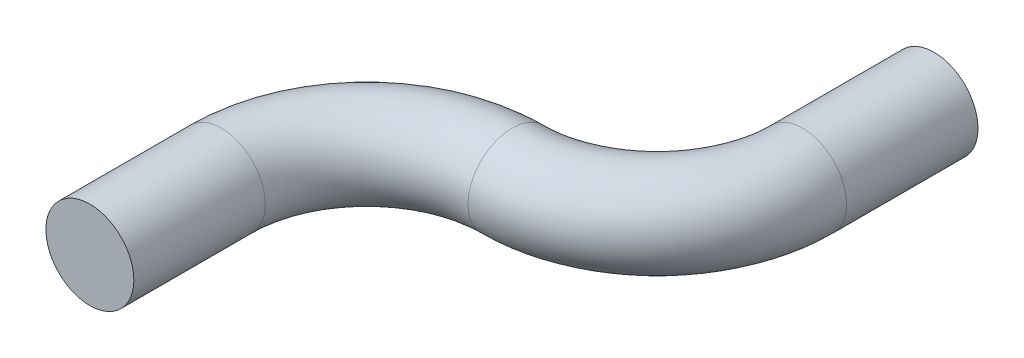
ISO-10303-21;
HEADER;
FILE_DESCRIPTION(('STEP AP214'),'2;1');
FILE_NAME('part.step','',(''),(''),'','','');
FILE_SCHEMA(('AUTOMOTIVE_DESIGN { 1 0 10303 214 1 1 1 1 }'));
ENDSEC;
DATA;
#1=APPLICATION_CONTEXT('core data for automotive mechanical design processes');
#2=APPLICATION_PROTOCOL_DEFINITION('international standard','automotive_design',2000,#1);
#3=PRODUCT_CONTEXT('',#1,'mechanical');
#4=PRODUCT('Part','Part','',(#3));
#5=PRODUCT_RELATED_PRODUCT_CATEGORY('part','',(#4));
#6=PRODUCT_DEFINITION_FORMATION('','',#4);
#7=PRODUCT_DEFINITION_CONTEXT('part definition',#1,'design');
#8=PRODUCT_DEFINITION('design','',#6,#7);
#9=PRODUCT_DEFINITION_SHAPE('','',#8);
#10=(LENGTH_UNIT() NAMED_UNIT(*) SI_UNIT(.MILLI.,.METRE.));
#11=(NAMED_UNIT(*) PLANE_ANGLE_UNIT() SI_UNIT($,.RADIAN.));
#12=(NAMED_UNIT(*) SI_UNIT($,.STERADIAN.) SOLID_ANGLE_UNIT());
#13=UNCERTAINTY_MEASURE_WITH_UNIT(LENGTH_MEASURE(1.E-05),#10,'distance_accuracy_value','');
#14=(GEOMETRIC_REPRESENTATION_CONTEXT(3) GLOBAL_UNCERTAINTY_ASSIGNED_CONTEXT((#13)) GLOBAL_UNIT_ASSIGNED_CONTEXT((#10,
#11,#12)) REPRESENTATION_CONTEXT('',''));
#15=CARTESIAN_POINT('',(0.,0.,0.));
#16=DIRECTION('',(0.,0.,1.));
#17=DIRECTION('',(1.,0.,0.));
#18=AXIS2_PLACEMENT_3D('',#15,#16,#17);
#19=CARTESIAN_POINT('',(100.485372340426,0.,-145.943040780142));
#20=DIRECTION('',(0.,0.,-1.));
#21=DIRECTION('',(-1.,0.,0.));
#22=AXIS2_PLACEMENT_3D('',#19,#20,#21);
#23=CYLINDRICAL_SURFACE('',#22,15.202778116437);
#24=CARTESIAN_POINT('',(100.485372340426,0.,-145.943040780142));
#25=DIRECTION('',(0.,0.,1.));
#26=DIRECTION('',(1.,0.,0.));
#27=AXIS2_PLACEMENT_3D('',#24,#25,#26);
#28=CIRCLE('',#27,15.202778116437);
#29=CARTESIAN_POINT('',(115.688150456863,0.,-145.943040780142));
#30=VERTEX_POINT('',#29);
#31=EDGE_CURVE('E35',#30,#30,#28,.T.);
#32=ORIENTED_EDGE('',*,*,#31,.F.);
#33=EDGE_LOOP('',(#32));
#34=FACE_BOUND('',#33,.T.);
#35=CARTESIAN_POINT('',(100.485372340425,0.,-191.400709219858));
#36=DIRECTION('',(0.,0.,1.));
#37=DIRECTION('',(1.,0.,0.));
#38=AXIS2_PLACEMENT_3D('',#35,#36,#37);
#39=CIRCLE('',#38,15.202778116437);
#40=CARTESIAN_POINT('',(115.688150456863,0.,-191.400709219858));
#41=VERTEX_POINT('',#40);
#42=EDGE_CURVE('E10',#41,#41,#39,.T.);
#43=ORIENTED_EDGE('',*,*,#42,.T.);
#44=EDGE_LOOP('',(#43));
#45=FACE_BOUND('',#44,.T.);
#46=ADVANCED_FACE('F29',(#34,#45),#23,.T.);
#47=CARTESIAN_POINT('',(50.2426861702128,0.,-145.943040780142));
#48=DIRECTION('',(0.,1.,0.));
#49=DIRECTION('',(0.,0.,1.));
#50=AXIS2_PLACEMENT_3D('',#47,#48,#49);
#51=TOROIDAL_SURFACE('',#50,50.2426861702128,15.202778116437);
#52=CARTESIAN_POINT('',(50.2426861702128,0.,-95.7003546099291));
#53=DIRECTION('',(-1.,0.,0.));
#54=DIRECTION('',(0.,0.,1.));
#55=AXIS2_PLACEMENT_3D('',#52,#53,#54);
#56=CIRCLE('',#55,15.202778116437);
#57=CARTESIAN_POINT('',(50.2426861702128,0.,-80.497576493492));
#58=VERTEX_POINT('',#57);
#59=EDGE_CURVE('E39',#58,#58,#56,.T.);
#60=CARTESIAN_POINT('',(50.2426861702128,0.,-145.943040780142));
#61=DIRECTION('',(0.,1.,0.));
#62=DIRECTION('',(0.,0.,1.));
#63=AXIS2_PLACEMENT_3D('',#60,#61,#62);
#64=CIRCLE('',#63,65.4454642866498);
#65=EDGE_CURVE('',#58,#30,#64,.T.);
#66=ORIENTED_EDGE('',*,*,#59,.F.);
#67=ORIENTED_EDGE('',*,*,#31,.T.);
#68=ORIENTED_EDGE('',*,*,#65,.T.);
#69=ORIENTED_EDGE('',*,*,#65,.F.);
#70=EDGE_LOOP('',(#66,#68,#67,#69));
#71=FACE_BOUND('',#70,.T.);
#72=ADVANCED_FACE('F66',(#71),#51,.T.);
#73=CARTESIAN_POINT('',(50.2426861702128,0.,-45.4576684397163));
#74=DIRECTION('',(0.,-1.,0.));
#75=DIRECTION('',(0.,0.,-1.));
#76=AXIS2_PLACEMENT_3D('',#73,#74,#75);
#77=TOROIDAL_SURFACE('',#76,50.2426861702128,15.202778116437);
#78=CARTESIAN_POINT('',(0.,0.,-45.4576684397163));
#79=DIRECTION('',(0.,0.,1.));
#80=DIRECTION('',(1.,0.,0.));
#81=AXIS2_PLACEMENT_3D('',#78,#79,#80);
#82=CIRCLE('',#81,15.202778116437);
#83=CARTESIAN_POINT('',(15.202778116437,0.,-45.4576684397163));
#84=VERTEX_POINT('',#83);
#85=EDGE_CURVE('E43',#84,#84,#82,.T.);
#86=ORIENTED_EDGE('',*,*,#85,.F.);
#87=EDGE_LOOP('',(#86));
#88=FACE_BOUND('',#87,.T.);
#89=ORIENTED_EDGE('',*,*,#59,.T.);
#90=EDGE_LOOP('',(#89));
#91=FACE_BOUND('',#90,.T.);
#92=ADVANCED_FACE('F57',(#88,#91),#77,.T.);
#93=CARTESIAN_POINT('',(0.,0.,-45.4576684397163));
#94=DIRECTION('',(0.,0.,1.));
#95=DIRECTION('',(1.,0.,0.));
#96=AXIS2_PLACEMENT_3D('',#93,#94,#95);
#97=CYLINDRICAL_SURFACE('',#96,15.202778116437);
#98=ORIENTED_EDGE('',*,*,#85,.T.);
#99=EDGE_LOOP('',(#98));
#100=FACE_BOUND('',#99,.T.);
#101=CARTESIAN_POINT('',(0.,0.,0.));
#102=DIRECTION('',(0.,0.,1.));
#103=DIRECTION('',(1.,0.,0.));
#104=AXIS2_PLACEMENT_3D('',#101,#102,#103);
#105=CIRCLE('',#104,15.202778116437);
#106=CARTESIAN_POINT('',(15.202778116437,0.,0.));
#107=VERTEX_POINT('',#106);
#108=EDGE_CURVE('E48',#107,#107,#105,.T.);
#109=ORIENTED_EDGE('',*,*,#108,.F.);
#110=EDGE_LOOP('',(#109));
#111=FACE_BOUND('',#110,.T.);
#112=ADVANCED_FACE('F54',(#100,#111),#97,.T.);
#113=CARTESIAN_POINT('',(100.485372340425,0.,-191.400709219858));
#114=DIRECTION('',(0.,0.,1.));
#115=DIRECTION('',(1.,0.,0.));
#116=AXIS2_PLACEMENT_3D('',#113,#114,#115);
#117=PLANE('',#116);
#118=ORIENTED_EDGE('',*,*,#42,.F.);
#119=EDGE_LOOP('',(#118));
#120=FACE_BOUND('',#119,.T.);
#121=ADVANCED_FACE('F56',(#120),#117,.F.);
#122=CARTESIAN_POINT('',(0.,0.,0.));
#123=DIRECTION('',(0.,0.,1.));
#124=DIRECTION('',(1.,0.,0.));
#125=AXIS2_PLACEMENT_3D('',#122,#123,#124);
#126=PLANE('',#125);
#127=ORIENTED_EDGE('',*,*,#108,.T.);
#128=EDGE_LOOP('',(#127));
#129=FACE_BOUND('',#128,.T.);
#130=ADVANCED_FACE('F52',(#129),#126,.T.);
#131=CLOSED_SHELL('',(#46,#72,#92,#112,#121,#130));
#132=MANIFOLD_SOLID_BREP('B2',#131);
#133=ADVANCED_BREP_SHAPE_REPRESENTATION('',(#18,#132),#14);
#134=SHAPE_DEFINITION_REPRESENTATION(#9,#133);
ENDSEC;
END-ISO-10303-21;
